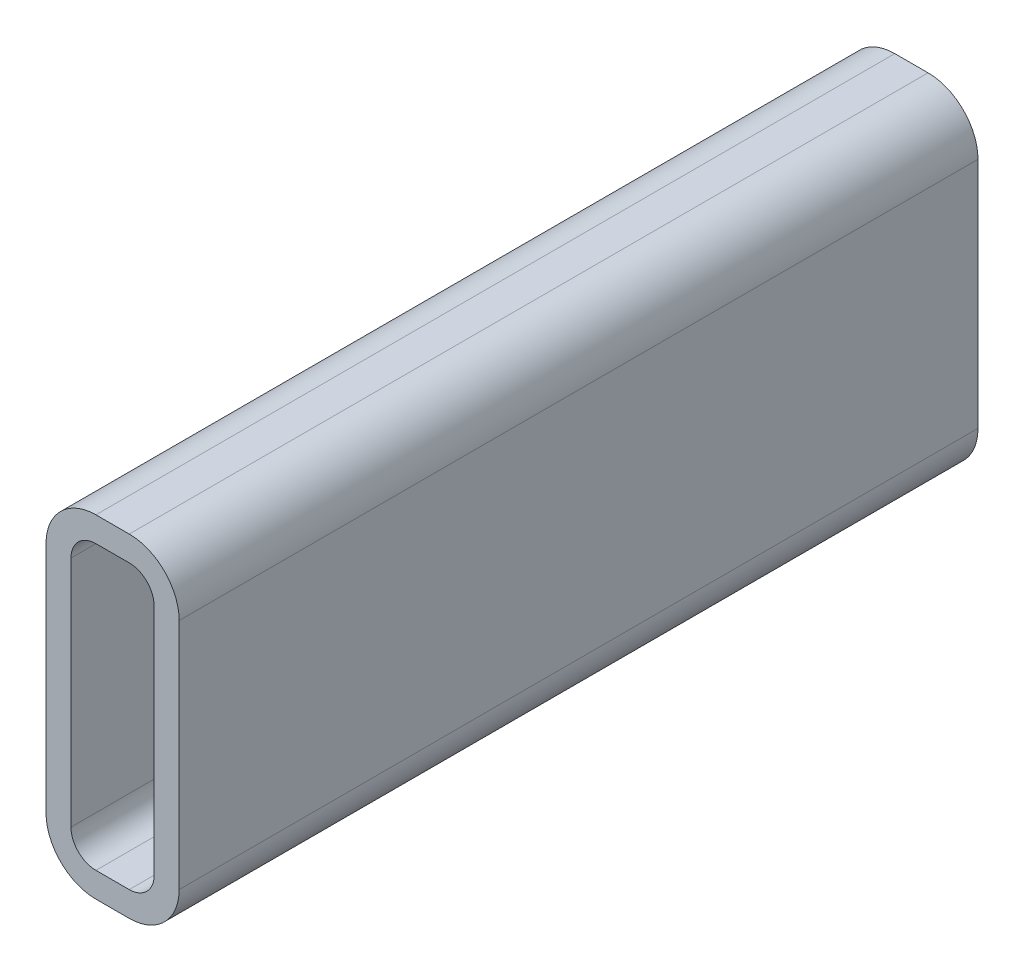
from build123d import *

# Parameters (mm, degrees)
BOSS_EXTRUDE1_DEPTH = 304.8


with BuildPart() as part:
    # Sketch1 → Boss-Extrude1 (new body)
    with BuildSketch(Plane.XY):
        with BuildLine():
            Line((19.05, 127), (31.75, 127))
            ThreePointArc((31.75, 127), (45.220384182, 121.420384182), (50.8, 107.95))
            Line((50.8, 107.95), (50.8, 19.05))
            ThreePointArc((50.8, 19.05), (45.220384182, 5.579615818), (31.75, 0))
            Line((31.75, 0), (19.05, 0))
            ThreePointArc((19.05, 0), (5.579615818, 5.579615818), (0, 19.05))
            Line((0, 19.05), (0, 107.95))
            ThreePointArc((0, 107.95), (5.579615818, 121.420384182), (19.05, 127))
        make_face()
        with BuildLine():
            Line((19.05, 117.475), (31.75, 117.475))
            ThreePointArc((31.75, 117.475), (38.485192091, 114.685192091), (41.275, 107.95))
            Line((41.275, 107.95), (41.275, 19.05))
            ThreePointArc((41.275, 19.05), (38.485192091, 12.314807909), (31.75, 9.525))
            Line((31.75, 9.525), (19.05, 9.525))
            ThreePointArc((19.05, 9.525), (12.314807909, 12.314807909), (9.525, 19.05))
            Line((9.525, 19.05), (9.525, 107.95))
            ThreePointArc((9.525, 107.95), (12.314807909, 114.685192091), (19.05, 117.475))
        make_face(mode=Mode.SUBTRACT)
    extrude(amount=BOSS_EXTRUDE1_DEPTH)


solid = part.part
